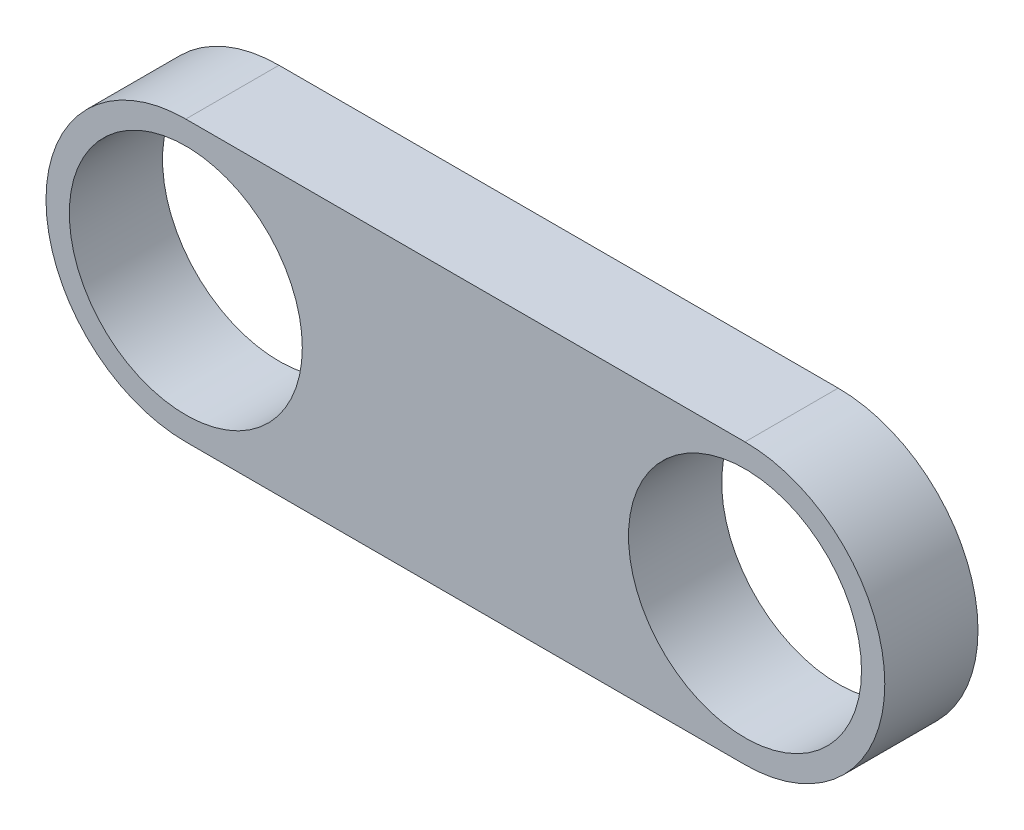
ISO-10303-21;
HEADER;
FILE_DESCRIPTION(('STEP AP214'),'2;1');
FILE_NAME('part.step','',(''),(''),'','','');
FILE_SCHEMA(('AUTOMOTIVE_DESIGN { 1 0 10303 214 1 1 1 1 }'));
ENDSEC;
DATA;
#1=APPLICATION_CONTEXT('core data for automotive mechanical design processes');
#2=APPLICATION_PROTOCOL_DEFINITION('international standard','automotive_design',2000,#1);
#3=PRODUCT_CONTEXT('',#1,'mechanical');
#4=PRODUCT('Part','Part','',(#3));
#5=PRODUCT_RELATED_PRODUCT_CATEGORY('part','',(#4));
#6=PRODUCT_DEFINITION_FORMATION('','',#4);
#7=PRODUCT_DEFINITION_CONTEXT('part definition',#1,'design');
#8=PRODUCT_DEFINITION('design','',#6,#7);
#9=PRODUCT_DEFINITION_SHAPE('','',#8);
#10=(LENGTH_UNIT() NAMED_UNIT(*) SI_UNIT(.MILLI.,.METRE.));
#11=(NAMED_UNIT(*) PLANE_ANGLE_UNIT() SI_UNIT($,.RADIAN.));
#12=(NAMED_UNIT(*) SI_UNIT($,.STERADIAN.) SOLID_ANGLE_UNIT());
#13=UNCERTAINTY_MEASURE_WITH_UNIT(LENGTH_MEASURE(1.E-05),#10,'distance_accuracy_value','');
#14=(GEOMETRIC_REPRESENTATION_CONTEXT(3) GLOBAL_UNCERTAINTY_ASSIGNED_CONTEXT((#13)) GLOBAL_UNIT_ASSIGNED_CONTEXT((#10,
#11,#12)) REPRESENTATION_CONTEXT('',''));
#15=CARTESIAN_POINT('',(0.,0.,0.));
#16=DIRECTION('',(0.,0.,1.));
#17=DIRECTION('',(1.,0.,0.));
#18=AXIS2_PLACEMENT_3D('',#15,#16,#17);
#19=CARTESIAN_POINT('',(0.,0.,10.));
#20=DIRECTION('',(0.,0.,1.));
#21=DIRECTION('',(1.,0.,0.));
#22=AXIS2_PLACEMENT_3D('',#19,#20,#21);
#23=PLANE('',#22);
#24=CARTESIAN_POINT('',(0.,0.,10.));
#25=DIRECTION('',(0.,0.,1.));
#26=DIRECTION('',(1.,0.,0.));
#27=AXIS2_PLACEMENT_3D('',#24,#25,#26);
#28=CIRCLE('',#27,12.5);
#29=CARTESIAN_POINT('',(12.5,0.,10.));
#30=VERTEX_POINT('',#29);
#31=EDGE_CURVE('E100',#30,#30,#28,.T.);
#32=ORIENTED_EDGE('',*,*,#31,.F.);
#33=EDGE_LOOP('',(#32));
#34=FACE_BOUND('',#33,.T.);
#35=CARTESIAN_POINT('',(0.,0.,10.));
#36=DIRECTION('',(0.,0.,1.));
#37=DIRECTION('',(1.,0.,0.));
#38=AXIS2_PLACEMENT_3D('',#35,#36,#37);
#39=CIRCLE('',#38,15.);
#40=CARTESIAN_POINT('',(0.,15.,10.));
#41=VERTEX_POINT('',#40);
#42=CARTESIAN_POINT('',(0.,-15.,10.));
#43=VERTEX_POINT('',#42);
#44=EDGE_CURVE('E85',#41,#43,#39,.T.);
#45=ORIENTED_EDGE('',*,*,#44,.T.);
#46=DIRECTION('',(1.,0.,0.));
#47=VECTOR('',#46,1.);
#48=CARTESIAN_POINT('',(0.,-15.,10.));
#49=LINE('',#48,#47);
#50=CARTESIAN_POINT('',(60.,-15.,10.));
#51=VERTEX_POINT('',#50);
#52=EDGE_CURVE('E80',#43,#51,#49,.T.);
#53=ORIENTED_EDGE('',*,*,#52,.T.);
#54=CARTESIAN_POINT('',(60.,0.,10.));
#55=DIRECTION('',(0.,0.,1.));
#56=DIRECTION('',(1.,0.,0.));
#57=AXIS2_PLACEMENT_3D('',#54,#55,#56);
#58=CIRCLE('',#57,15.);
#59=CARTESIAN_POINT('',(60.,15.,10.));
#60=VERTEX_POINT('',#59);
#61=EDGE_CURVE('E83',#51,#60,#58,.T.);
#62=ORIENTED_EDGE('',*,*,#61,.T.);
#63=DIRECTION('',(-1.,0.,0.));
#64=VECTOR('',#63,1.);
#65=CARTESIAN_POINT('',(0.,15.,10.));
#66=LINE('',#65,#64);
#67=EDGE_CURVE('E50',#60,#41,#66,.T.);
#68=ORIENTED_EDGE('',*,*,#67,.T.);
#69=EDGE_LOOP('',(#45,#53,#62,#68));
#70=FACE_BOUND('',#69,.T.);
#71=CARTESIAN_POINT('',(60.,0.,10.));
#72=DIRECTION('',(0.,0.,1.));
#73=DIRECTION('',(1.,0.,0.));
#74=AXIS2_PLACEMENT_3D('',#71,#72,#73);
#75=CIRCLE('',#74,12.5);
#76=CARTESIAN_POINT('',(72.5,0.,10.));
#77=VERTEX_POINT('',#76);
#78=EDGE_CURVE('E115',#77,#77,#75,.T.);
#79=ORIENTED_EDGE('',*,*,#78,.F.);
#80=EDGE_LOOP('',(#79));
#81=FACE_BOUND('',#80,.T.);
#82=ADVANCED_FACE('F33',(#34,#70,#81),#23,.T.);
#83=CARTESIAN_POINT('',(0.,0.,0.));
#84=DIRECTION('',(0.,0.,1.));
#85=DIRECTION('',(1.,0.,0.));
#86=AXIS2_PLACEMENT_3D('',#83,#84,#85);
#87=PLANE('',#86);
#88=CARTESIAN_POINT('',(0.,0.,0.));
#89=DIRECTION('',(0.,0.,1.));
#90=DIRECTION('',(1.,0.,0.));
#91=AXIS2_PLACEMENT_3D('',#88,#89,#90);
#92=CIRCLE('',#91,15.);
#93=CARTESIAN_POINT('',(0.,15.,0.));
#94=VERTEX_POINT('',#93);
#95=CARTESIAN_POINT('',(0.,-15.,0.));
#96=VERTEX_POINT('',#95);
#97=EDGE_CURVE('E97',#94,#96,#92,.T.);
#98=ORIENTED_EDGE('',*,*,#97,.F.);
#99=DIRECTION('',(-1.,0.,0.));
#100=VECTOR('',#99,1.);
#101=CARTESIAN_POINT('',(0.,15.,0.));
#102=LINE('',#101,#100);
#103=CARTESIAN_POINT('',(60.,15.,0.));
#104=VERTEX_POINT('',#103);
#105=EDGE_CURVE('E73',#104,#94,#102,.T.);
#106=ORIENTED_EDGE('',*,*,#105,.F.);
#107=CARTESIAN_POINT('',(60.,0.,0.));
#108=DIRECTION('',(0.,0.,1.));
#109=DIRECTION('',(1.,0.,0.));
#110=AXIS2_PLACEMENT_3D('',#107,#108,#109);
#111=CIRCLE('',#110,15.);
#112=CARTESIAN_POINT('',(60.,-15.,0.));
#113=VERTEX_POINT('',#112);
#114=EDGE_CURVE('E67',#113,#104,#111,.T.);
#115=ORIENTED_EDGE('',*,*,#114,.F.);
#116=DIRECTION('',(1.,0.,0.));
#117=VECTOR('',#116,1.);
#118=CARTESIAN_POINT('',(0.,-15.,0.));
#119=LINE('',#118,#117);
#120=EDGE_CURVE('E89',#96,#113,#119,.T.);
#121=ORIENTED_EDGE('',*,*,#120,.F.);
#122=EDGE_LOOP('',(#98,#106,#115,#121));
#123=FACE_BOUND('',#122,.T.);
#124=CARTESIAN_POINT('',(0.,0.,0.));
#125=DIRECTION('',(0.,0.,1.));
#126=DIRECTION('',(1.,0.,0.));
#127=AXIS2_PLACEMENT_3D('',#124,#125,#126);
#128=CIRCLE('',#127,12.5);
#129=CARTESIAN_POINT('',(12.5,0.,0.));
#130=VERTEX_POINT('',#129);
#131=EDGE_CURVE('E112',#130,#130,#128,.T.);
#132=ORIENTED_EDGE('',*,*,#131,.T.);
#133=EDGE_LOOP('',(#132));
#134=FACE_BOUND('',#133,.T.);
#135=CARTESIAN_POINT('',(60.,0.,0.));
#136=DIRECTION('',(0.,0.,1.));
#137=DIRECTION('',(1.,0.,0.));
#138=AXIS2_PLACEMENT_3D('',#135,#136,#137);
#139=CIRCLE('',#138,12.5);
#140=CARTESIAN_POINT('',(72.5,0.,0.));
#141=VERTEX_POINT('',#140);
#142=EDGE_CURVE('E118',#141,#141,#139,.T.);
#143=ORIENTED_EDGE('',*,*,#142,.T.);
#144=EDGE_LOOP('',(#143));
#145=FACE_BOUND('',#144,.T.);
#146=ADVANCED_FACE('F108',(#123,#134,#145),#87,.F.);
#147=CARTESIAN_POINT('',(0.,0.,10.));
#148=DIRECTION('',(0.,0.,-1.));
#149=DIRECTION('',(-1.,0.,0.));
#150=AXIS2_PLACEMENT_3D('',#147,#148,#149);
#151=CYLINDRICAL_SURFACE('',#150,15.);
#152=ORIENTED_EDGE('',*,*,#97,.T.);
#153=DIRECTION('',(0.,0.,-1.));
#154=VECTOR('',#153,1.);
#155=CARTESIAN_POINT('',(0.,-15.,10.));
#156=LINE('',#155,#154);
#157=EDGE_CURVE('E11',#43,#96,#156,.T.);
#158=ORIENTED_EDGE('',*,*,#157,.F.);
#159=ORIENTED_EDGE('',*,*,#44,.F.);
#160=DIRECTION('',(0.,0.,-1.));
#161=VECTOR('',#160,1.);
#162=CARTESIAN_POINT('',(0.,15.,10.));
#163=LINE('',#162,#161);
#164=EDGE_CURVE('E93',#41,#94,#163,.T.);
#165=ORIENTED_EDGE('',*,*,#164,.T.);
#166=EDGE_LOOP('',(#152,#158,#159,#165));
#167=FACE_BOUND('',#166,.T.);
#168=ADVANCED_FACE('F35',(#167),#151,.T.);
#169=CARTESIAN_POINT('',(0.,-15.,10.));
#170=DIRECTION('',(0.,1.,0.));
#171=DIRECTION('',(0.,0.,1.));
#172=AXIS2_PLACEMENT_3D('',#169,#170,#171);
#173=PLANE('',#172);
#174=ORIENTED_EDGE('',*,*,#120,.T.);
#175=DIRECTION('',(0.,0.,-1.));
#176=VECTOR('',#175,1.);
#177=CARTESIAN_POINT('',(60.,-15.,10.));
#178=LINE('',#177,#176);
#179=EDGE_CURVE('E42',#51,#113,#178,.T.);
#180=ORIENTED_EDGE('',*,*,#179,.F.);
#181=ORIENTED_EDGE('',*,*,#52,.F.);
#182=ORIENTED_EDGE('',*,*,#157,.T.);
#183=EDGE_LOOP('',(#174,#180,#181,#182));
#184=FACE_BOUND('',#183,.T.);
#185=ADVANCED_FACE('F88',(#184),#173,.F.);
#186=CARTESIAN_POINT('',(60.,0.,10.));
#187=DIRECTION('',(0.,0.,-1.));
#188=DIRECTION('',(-1.,0.,0.));
#189=AXIS2_PLACEMENT_3D('',#186,#187,#188);
#190=CYLINDRICAL_SURFACE('',#189,15.);
#191=ORIENTED_EDGE('',*,*,#114,.T.);
#192=DIRECTION('',(0.,0.,-1.));
#193=VECTOR('',#192,1.);
#194=CARTESIAN_POINT('',(60.,15.,10.));
#195=LINE('',#194,#193);
#196=EDGE_CURVE('E90',#60,#104,#195,.T.);
#197=ORIENTED_EDGE('',*,*,#196,.F.);
#198=ORIENTED_EDGE('',*,*,#61,.F.);
#199=ORIENTED_EDGE('',*,*,#179,.T.);
#200=EDGE_LOOP('',(#191,#197,#198,#199));
#201=FACE_BOUND('',#200,.T.);
#202=ADVANCED_FACE('F91',(#201),#190,.T.);
#203=CARTESIAN_POINT('',(0.,15.,10.));
#204=DIRECTION('',(0.,-1.,0.));
#205=DIRECTION('',(0.,0.,-1.));
#206=AXIS2_PLACEMENT_3D('',#203,#204,#205);
#207=PLANE('',#206);
#208=ORIENTED_EDGE('',*,*,#105,.T.);
#209=ORIENTED_EDGE('',*,*,#164,.F.);
#210=ORIENTED_EDGE('',*,*,#67,.F.);
#211=ORIENTED_EDGE('',*,*,#196,.T.);
#212=EDGE_LOOP('',(#208,#209,#210,#211));
#213=FACE_BOUND('',#212,.T.);
#214=ADVANCED_FACE('F105',(#213),#207,.F.);
#215=CARTESIAN_POINT('',(0.,0.,10.));
#216=DIRECTION('',(0.,0.,-1.));
#217=DIRECTION('',(-1.,0.,0.));
#218=AXIS2_PLACEMENT_3D('',#215,#216,#217);
#219=CYLINDRICAL_SURFACE('',#218,12.5);
#220=ORIENTED_EDGE('',*,*,#31,.T.);
#221=EDGE_LOOP('',(#220));
#222=FACE_BOUND('',#221,.T.);
#223=ORIENTED_EDGE('',*,*,#131,.F.);
#224=EDGE_LOOP('',(#223));
#225=FACE_BOUND('',#224,.T.);
#226=ADVANCED_FACE('F135',(#222,#225),#219,.F.);
#227=CARTESIAN_POINT('',(60.,0.,10.));
#228=DIRECTION('',(0.,0.,-1.));
#229=DIRECTION('',(-1.,0.,0.));
#230=AXIS2_PLACEMENT_3D('',#227,#228,#229);
#231=CYLINDRICAL_SURFACE('',#230,12.5);
#232=ORIENTED_EDGE('',*,*,#78,.T.);
#233=EDGE_LOOP('',(#232));
#234=FACE_BOUND('',#233,.T.);
#235=ORIENTED_EDGE('',*,*,#142,.F.);
#236=EDGE_LOOP('',(#235));
#237=FACE_BOUND('',#236,.T.);
#238=ADVANCED_FACE('F124',(#234,#237),#231,.F.);
#239=CLOSED_SHELL('',(#82,#146,#168,#185,#202,#214,#226,#238));
#240=MANIFOLD_SOLID_BREP('B2',#239);
#241=ADVANCED_BREP_SHAPE_REPRESENTATION('',(#18,#240),#14);
#242=SHAPE_DEFINITION_REPRESENTATION(#9,#241);
ENDSEC;
END-ISO-10303-21;
